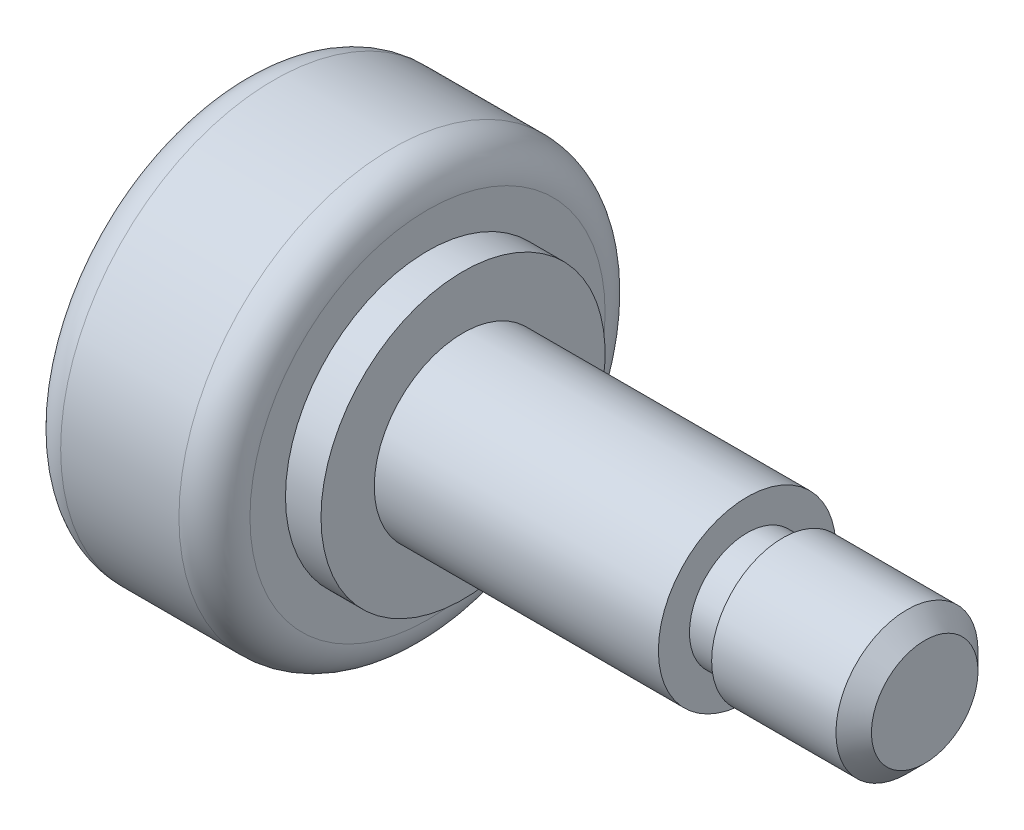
from build123d import *

# Parameters (mm, degrees)
SKETCH_1_W     = 2
SKETCH_1_H     = 3.25
CHAMFER_1_SIZE = 1


with BuildPart() as part:
    # Sketch 1 → Revolve 1 (revolve)
    with BuildSketch(Plane.XY, mode=Mode.PRIVATE) as revolve_1_sk:
        with BuildLine():
            ThreePointArc((1.409888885, 10.526315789), (0.354039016, 5.310157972), (0, 0))
            Line((0, 0), (12, 0))
            Line((12, 0), (12, 8))
            Line((12, 8), (12, 10))
            ThreePointArc((12, 10), (11.414213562, 11.414213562), (10, 12))
            Line((10, 12), (3.33939444, 12))
            ThreePointArc((3.33939444, 12), (2.125440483, 11.589438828), (1.409888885, 10.526315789))
        make_face()
        Polygon((12, 8), (12, 0), (14, 0), (14, 5), (14, 8), align=None)
        Polygon((14, 5), (14, 0), (30, 0), (30, 3.25), (30, 5), align=None)
        with Locations((31, 1.625)):
            Rectangle(SKETCH_1_W, SKETCH_1_H)
        Polygon((32, 3.25), (32, 0), (40, 0), (40, 4), (32, 4), align=None)
    revolve(revolve_1_sk.sketch.rotate(Axis((0, 0, 0), (1, 0, 0)), 90), axis=Axis((0, 0, 0), (1, 0, 0)))

    # Chamfer 1
    chamfer_1_edges = [part.edges().sort_by_distance(p)[0] for p in [
        (40, 0, -4),
    ]]
    chamfer(chamfer_1_edges, length=CHAMFER_1_SIZE)


solid = part.part
